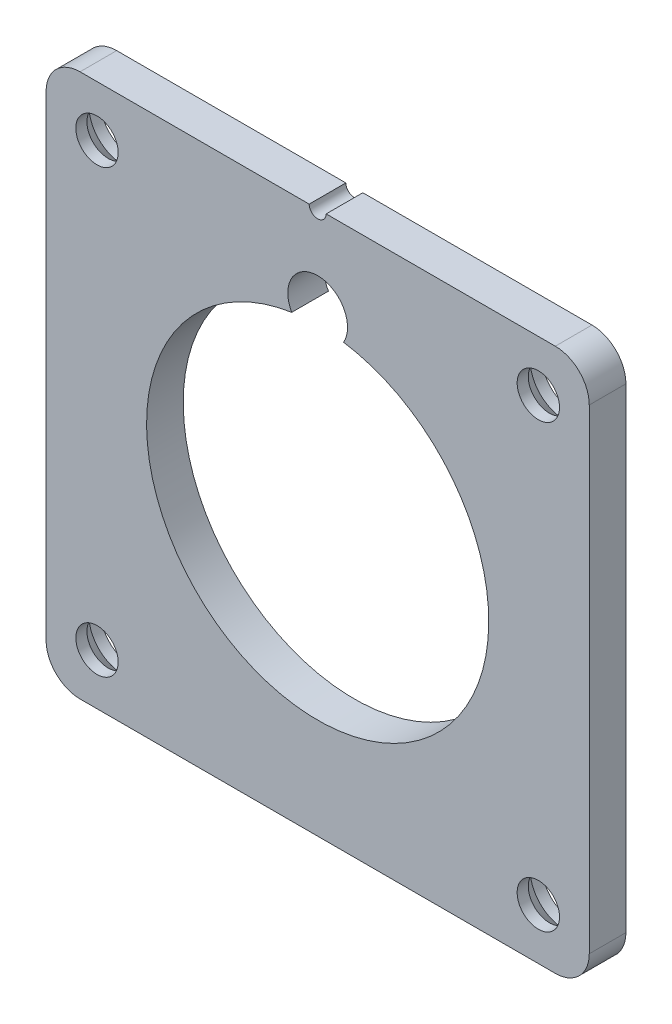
from build123d import *

# Parameters (mm, degrees)
SKETCH1_W                                      = 101.6
SKETCH1_H                                      = 101.6
BOSS_EXTRUDE1_DEPTH                            = 6.858
FILLET1_R                                      = 6.35
CSK_FOR_5_16_FLAT_HEAD_MACHINE_SCREW1_AT_COUNT = 2
CSK_FOR_5_16_FLAT_HEAD_MACHINE_SCREW1_AT_PITCH = 82.55
CSK_FOR_5_16_FLAT_HEAD_MACHINE_SCREW_2_COUNT   = 2
CSK_FOR_5_16_FLAT_HEAD_MACHINE_SCREW_2_PITCH   = 116.743329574
CSK_FOR_5_16_FLAT_HEAD_MACHINE_SCREW_3_COUNT   = 2
CSK_FOR_5_16_FLAT_HEAD_MACHINE_SCREW_3_PITCH   = 82.55
SKETCH7_R                                      = 1.5875
CUT_EXTRUDE3_DEPTH                             = 73.168636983
CUT_EXTRUDE8_DEPTH                             = 73.168636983


with BuildPart() as part:
    # Sketch1 → Boss-Extrude1 (new body)
    with BuildSketch(Plane.XY):
        Rectangle(SKETCH1_W, SKETCH1_H)
    extrude(amount=BOSS_EXTRUDE1_DEPTH)

    # Fillet1
    fillet1_edges = [part.edges().sort_by_distance(p)[0] for p in [
        (-50.8, 50.8, 3.429),
        (50.8, 50.8, 3.429),
        (50.8, -50.8, 3.429),
        (-50.8, -50.8, 3.429),
    ]]
    fillet(fillet1_edges, radius=FILLET1_R)

    # Sketch6 → CSK for 5_16 Flat Head Machine Screw1 (revolve, cut)
    with BuildSketch(Plane(origin=(41.275, 41.275, 0), x_dir=(0, 1, 0), z_dir=(1, 0, 0))):
        Polygon((0, 0), (0, 6.858), (3.9624, 6.858), (3.9624, 4.778619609), (6.35, 2.032), (6.35, 0), align=None)
    csk_for_5_16_flat_head_machine_screw1 = revolve(axis=Axis((41.275, 41.275, -6.35), (0, 0, 1)), mode=Mode.SUBTRACT)

    # CSK for 5_16 Flat Head Machine Screw1 at: CSK for 5_16 Flat Head Machine Screw1 ×2
    with Locations(*[(-i * CSK_FOR_5_16_FLAT_HEAD_MACHINE_SCREW1_AT_PITCH, 0, 0) for i in range(1, CSK_FOR_5_16_FLAT_HEAD_MACHINE_SCREW1_AT_COUNT)]):
        add(csk_for_5_16_flat_head_machine_screw1, mode=Mode.SUBTRACT)

    # CSK for 5_16 Flat Head Machine Screw 2: CSK for 5_16 Flat Head Machine Screw1 ×2
    with Locations(*[Vector(-0.7071067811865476, -0.7071067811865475, 0) * (i * CSK_FOR_5_16_FLAT_HEAD_MACHINE_SCREW_2_PITCH) for i in range(1, CSK_FOR_5_16_FLAT_HEAD_MACHINE_SCREW_2_COUNT)]):
        add(csk_for_5_16_flat_head_machine_screw1, mode=Mode.SUBTRACT)

    # CSK for 5_16 Flat Head Machine Screw 3: CSK for 5_16 Flat Head Machine Screw1 ×2
    with Locations(*[(0, -i * CSK_FOR_5_16_FLAT_HEAD_MACHINE_SCREW_3_PITCH, 0) for i in range(1, CSK_FOR_5_16_FLAT_HEAD_MACHINE_SCREW_3_COUNT)]):
        add(csk_for_5_16_flat_head_machine_screw1, mode=Mode.SUBTRACT)

    # Sketch7 → Cut-Extrude3 (cut, through all)
    with BuildSketch(Plane(origin=(0, 0, 0), x_dir=(-1, 0, 0), z_dir=(0, 0, -1))):
        with Locations((0, 50.8)):
            Circle(SKETCH7_R)
    extrude(amount=-CUT_EXTRUDE3_DEPTH, mode=Mode.SUBTRACT)

    # Sketch8 → Cut-Extrude8 (cut, through all)
    with BuildSketch(Plane(origin=(0, 0, 0), x_dir=(-1, 0, 0), z_dir=(0, 0, -1))):
        with BuildLine():
            ThreePointArc((-4.846229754, 31.634950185), (0, -32.004), (4.846229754, 31.634950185))
            ThreePointArc((4.846229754, 31.634950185), (0, 40.005), (-4.846229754, 31.634950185))
        make_face()
    extrude(amount=-CUT_EXTRUDE8_DEPTH, mode=Mode.SUBTRACT)


solid = part.part
